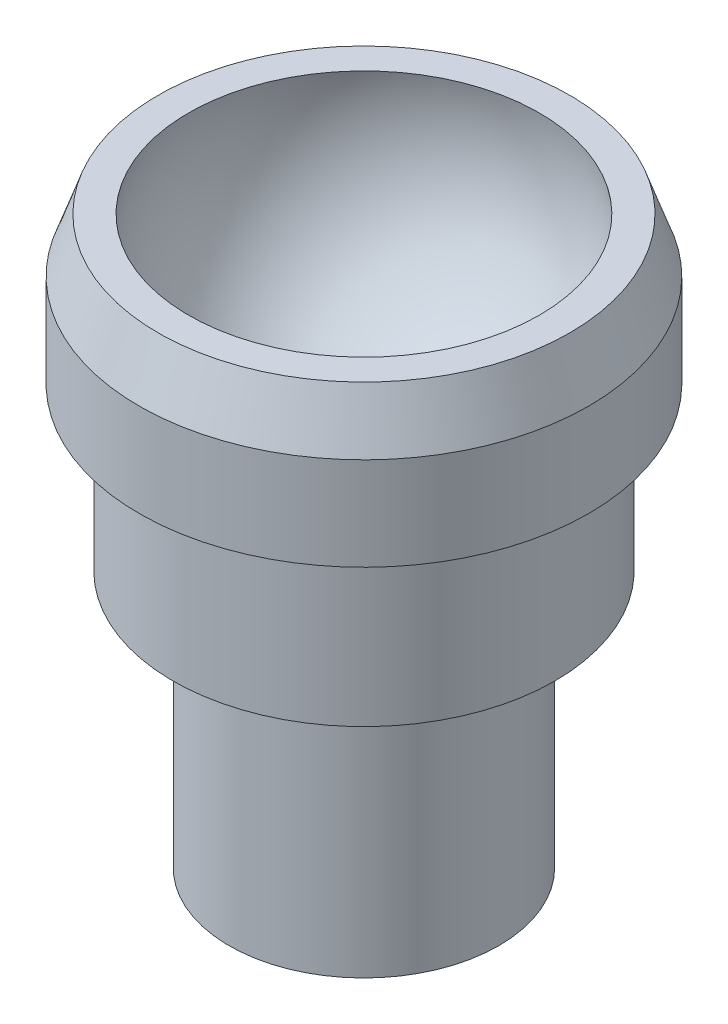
from build123d import *


with BuildPart() as part:
    # Esquisse1 → R_volution1 (revolve)
    with BuildSketch(Plane.XY):
        with BuildLine():
            Line((0, 3.963651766), (0, -12))
            Line((0, -12), (5.052768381, -12))
            Line((5.052768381, -12), (6, -11.45311557))
            Line((6, -11.45311557), (6, -1.74688443))
            Line((6, -1.74688443), (5.052768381, -1.2))
            Line((5.052768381, -1.2), (5.052768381, 0))
            Line((5.052768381, 0), (8.5, 0))
            Line((8.5, 0), (8.5, 7.2))
            Line((8.5, 7.2), (10, 7.2))
            Line((10, 7.2), (10, 11.34))
            Line((10, 11.34), (9.157816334, 13.74))
            Line((9.157816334, 13.74), (7.80029403, 13.74))
            ThreePointArc((7.80029403, 13.74), (6.253430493, 6.974202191), (0, 3.963651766))
        make_face()
    revolve(axis=Axis((0, 13.74, 0), (0, -1, 0)))


solid = part.part
